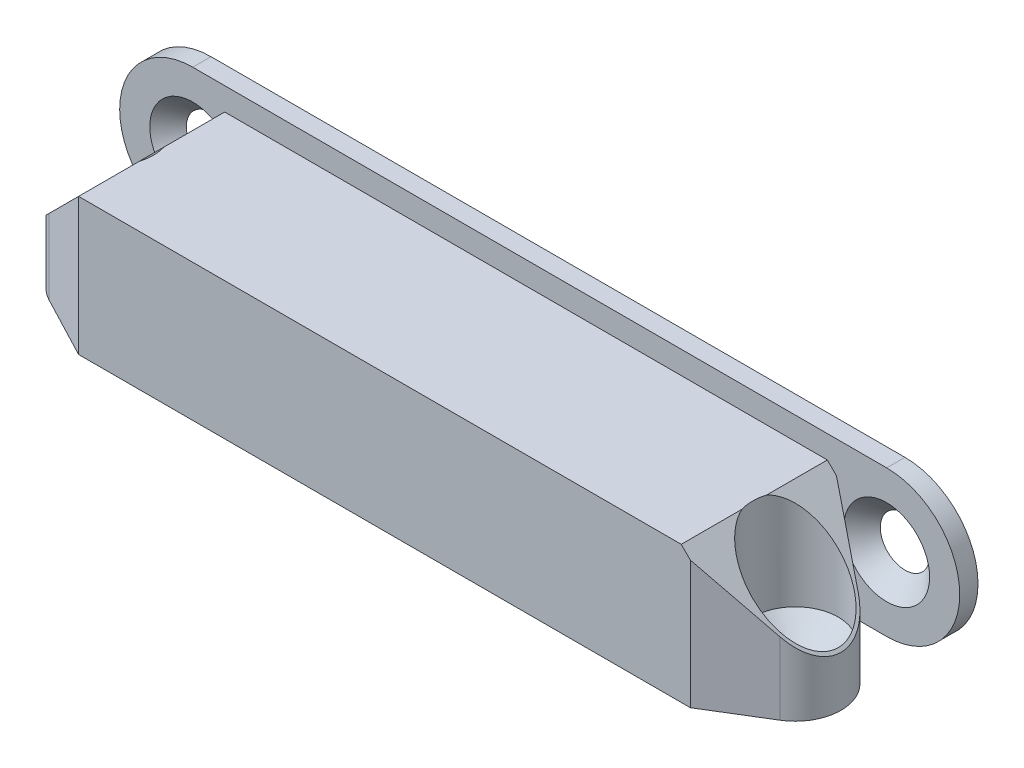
ISO-10303-21;
HEADER;
FILE_DESCRIPTION(('STEP AP214'),'2;1');
FILE_NAME('part.step','',(''),(''),'','','');
FILE_SCHEMA(('AUTOMOTIVE_DESIGN { 1 0 10303 214 1 1 1 1 }'));
ENDSEC;
DATA;
#1=APPLICATION_CONTEXT('core data for automotive mechanical design processes');
#2=APPLICATION_PROTOCOL_DEFINITION('international standard','automotive_design',2000,#1);
#3=PRODUCT_CONTEXT('',#1,'mechanical');
#4=PRODUCT('Part','Part','',(#3));
#5=PRODUCT_RELATED_PRODUCT_CATEGORY('part','',(#4));
#6=PRODUCT_DEFINITION_FORMATION('','',#4);
#7=PRODUCT_DEFINITION_CONTEXT('part definition',#1,'design');
#8=PRODUCT_DEFINITION('design','',#6,#7);
#9=PRODUCT_DEFINITION_SHAPE('','',#8);
#10=(LENGTH_UNIT() NAMED_UNIT(*) SI_UNIT(.MILLI.,.METRE.));
#11=(NAMED_UNIT(*) PLANE_ANGLE_UNIT() SI_UNIT($,.RADIAN.));
#12=(NAMED_UNIT(*) SI_UNIT($,.STERADIAN.) SOLID_ANGLE_UNIT());
#13=UNCERTAINTY_MEASURE_WITH_UNIT(LENGTH_MEASURE(1.E-05),#10,'distance_accuracy_value','');
#14=(GEOMETRIC_REPRESENTATION_CONTEXT(3) GLOBAL_UNCERTAINTY_ASSIGNED_CONTEXT((#13)) GLOBAL_UNIT_ASSIGNED_CONTEXT((#10,
#11,#12)) REPRESENTATION_CONTEXT('',''));
#15=CARTESIAN_POINT('',(0.,0.,0.));
#16=DIRECTION('',(0.,0.,1.));
#17=DIRECTION('',(1.,0.,0.));
#18=AXIS2_PLACEMENT_3D('',#15,#16,#17);
#19=CARTESIAN_POINT('',(34.,7.00000000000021,19.4999999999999));
#20=DIRECTION('',(0.,0.,1.));
#21=DIRECTION('',(1.,0.,0.));
#22=AXIS2_PLACEMENT_3D('',#19,#20,#21);
#23=PLANE('',#22);
#24=DIRECTION('',(0.,-1.,0.));
#25=VECTOR('',#24,1.);
#26=CARTESIAN_POINT('',(34.,7.00000000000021,19.4999999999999));
#27=LINE('',#26,#25);
#28=CARTESIAN_POINT('',(34.,6.00000000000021,19.4999999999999));
#29=VERTEX_POINT('',#28);
#30=CARTESIAN_POINT('',(34.,-7.99999999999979,19.4999999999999));
#31=VERTEX_POINT('',#30);
#32=EDGE_CURVE('E236',#29,#31,#27,.T.);
#33=ORIENTED_EDGE('',*,*,#32,.F.);
#34=DIRECTION('',(-0.707106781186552,0.707106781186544,0.));
#35=VECTOR('',#34,1.);
#36=CARTESIAN_POINT('',(33.,7.00000000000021,19.4999999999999));
#37=LINE('',#36,#35);
#38=CARTESIAN_POINT('',(33.,7.00000000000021,19.4999999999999));
#39=VERTEX_POINT('',#38);
#40=EDGE_CURVE('E150',#29,#39,#37,.T.);
#41=ORIENTED_EDGE('',*,*,#40,.T.);
#42=DIRECTION('',(-1.,0.,0.));
#43=VECTOR('',#42,1.);
#44=CARTESIAN_POINT('',(34.,7.00000000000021,19.4999999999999));
#45=LINE('',#44,#43);
#46=CARTESIAN_POINT('',(-33.0000000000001,7.0000000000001,19.5));
#47=VERTEX_POINT('',#46);
#48=EDGE_CURVE('E223',#39,#47,#45,.T.);
#49=ORIENTED_EDGE('',*,*,#48,.T.);
#50=DIRECTION('',(0.,-1.,0.));
#51=VECTOR('',#50,1.);
#52=CARTESIAN_POINT('',(-33.0000000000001,7.0000000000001,19.5));
#53=LINE('',#52,#51);
#54=CARTESIAN_POINT('',(-33.0000000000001,-7.99999999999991,19.5));
#55=VERTEX_POINT('',#54);
#56=EDGE_CURVE('E233',#47,#55,#53,.T.);
#57=ORIENTED_EDGE('',*,*,#56,.T.);
#58=DIRECTION('',(-1.,0.,0.));
#59=VECTOR('',#58,1.);
#60=CARTESIAN_POINT('',(34.,-7.99999999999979,19.4999999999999));
#61=LINE('',#60,#59);
#62=EDGE_CURVE('E208',#31,#55,#61,.T.);
#63=ORIENTED_EDGE('',*,*,#62,.F.);
#64=EDGE_LOOP('',(#33,#41,#49,#57,#63));
#65=FACE_BOUND('',#64,.T.);
#66=ADVANCED_FACE('F46',(#65),#23,.T.);
#67=CARTESIAN_POINT('',(40.1079530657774,7.00000000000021,15.7659794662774));
#68=DIRECTION('',(0.521590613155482,0.,0.853195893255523));
#69=DIRECTION('',(0.853195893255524,0.,-0.521590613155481));
#70=AXIS2_PLACEMENT_3D('',#67,#68,#69);
#71=PLANE('',#70);
#72=DIRECTION('',(0.,-1.,0.));
#73=VECTOR('',#72,1.);
#74=CARTESIAN_POINT('',(40.1079530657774,7.00000000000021,15.7659794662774));
#75=LINE('',#74,#73);
#76=CARTESIAN_POINT('',(40.1079530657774,-0.107953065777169,15.7659794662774));
#77=VERTEX_POINT('',#76);
#78=CARTESIAN_POINT('',(40.1079530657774,-7.99999999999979,15.7659794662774));
#79=VERTEX_POINT('',#78);
#80=EDGE_CURVE('E239',#77,#79,#75,.T.);
#81=ORIENTED_EDGE('',*,*,#80,.F.);
#82=DIRECTION('',(0.64905876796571,-0.649058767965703,-0.396793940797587));
#83=VECTOR('',#82,1.);
#84=CARTESIAN_POINT('',(37.2783843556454,2.72161564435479,17.4958008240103));
#85=LINE('',#84,#83);
#86=EDGE_CURVE('E292',#29,#77,#85,.T.);
#87=ORIENTED_EDGE('',*,*,#86,.F.);
#88=ORIENTED_EDGE('',*,*,#32,.T.);
#89=DIRECTION('',(-0.853195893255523,0.,0.521590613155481));
#90=VECTOR('',#89,1.);
#91=CARTESIAN_POINT('',(40.1079530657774,-7.99999999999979,15.7659794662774));
#92=LINE('',#91,#90);
#93=EDGE_CURVE('E204',#79,#31,#92,.T.);
#94=ORIENTED_EDGE('',*,*,#93,.F.);
#95=EDGE_LOOP('',(#81,#87,#88,#94));
#96=FACE_BOUND('',#95,.T.);
#97=ADVANCED_FACE('F289',(#96),#71,.T.);
#98=CARTESIAN_POINT('',(37.4999999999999,6.99999999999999,11.4999999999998));
#99=DIRECTION('',(0.,-1.,0.));
#100=DIRECTION('',(1.,0.,0.));
#101=AXIS2_PLACEMENT_3D('',#98,#99,#100);
#102=CYLINDRICAL_SURFACE('',#101,5.00000000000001);
#103=DIRECTION('',(0.,-1.,0.));
#104=VECTOR('',#103,1.);
#105=CARTESIAN_POINT('',(40.1079530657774,6.99999999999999,7.23402053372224));
#106=LINE('',#105,#104);
#107=CARTESIAN_POINT('',(40.1079530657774,-0.107953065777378,7.23402053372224));
#108=VERTEX_POINT('',#107);
#109=CARTESIAN_POINT('',(40.1079530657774,-8.00000000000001,7.23402053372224));
#110=VERTEX_POINT('',#109);
#111=EDGE_CURVE('E242',#108,#110,#106,.T.);
#112=ORIENTED_EDGE('',*,*,#111,.F.);
#113=CARTESIAN_POINT('',(37.4999999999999,2.50000000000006,11.4999999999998));
#114=DIRECTION('',(0.707106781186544,0.707106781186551,0.));
#115=DIRECTION('',(0.707106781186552,-0.707106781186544,0.));
#116=AXIS2_PLACEMENT_3D('',#113,#114,#115);
#117=ELLIPSE('',#116,7.07106781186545,5.00000000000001);
#118=EDGE_CURVE('E156',#77,#108,#117,.T.);
#119=ORIENTED_EDGE('',*,*,#118,.F.);
#120=ORIENTED_EDGE('',*,*,#80,.T.);
#121=CARTESIAN_POINT('',(37.4999999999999,-8.00000000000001,11.4999999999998));
#122=DIRECTION('',(0.,-1.,0.));
#123=DIRECTION('',(1.,0.,0.));
#124=AXIS2_PLACEMENT_3D('',#121,#122,#123);
#125=CIRCLE('',#124,5.00000000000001);
#126=EDGE_CURVE('E200',#110,#79,#125,.T.);
#127=ORIENTED_EDGE('',*,*,#126,.F.);
#128=EDGE_LOOP('',(#112,#119,#120,#127));
#129=FACE_BOUND('',#128,.T.);
#130=ADVANCED_FACE('F284',(#129),#102,.T.);
#131=CARTESIAN_POINT('',(34.,7.00000000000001,3.49999999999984));
#132=DIRECTION('',(0.52159061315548,0.,-0.853195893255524));
#133=DIRECTION('',(-0.853195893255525,0.,-0.521590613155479));
#134=AXIS2_PLACEMENT_3D('',#131,#132,#133);
#135=PLANE('',#134);
#136=DIRECTION('',(0.,-1.,0.));
#137=VECTOR('',#136,1.);
#138=CARTESIAN_POINT('',(34.,7.00000000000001,3.49999999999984));
#139=LINE('',#138,#137);
#140=CARTESIAN_POINT('',(34.,6.00000000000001,3.49999999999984));
#141=VERTEX_POINT('',#140);
#142=CARTESIAN_POINT('',(34.,-8.00000000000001,3.49999999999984));
#143=VERTEX_POINT('',#142);
#144=EDGE_CURVE('E245',#141,#143,#139,.T.);
#145=ORIENTED_EDGE('',*,*,#144,.F.);
#146=DIRECTION('',(-0.649058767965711,0.649058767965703,-0.396793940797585));
#147=VECTOR('',#146,1.);
#148=CARTESIAN_POINT('',(33.1571878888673,6.84281211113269,2.98475738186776));
#149=LINE('',#148,#147);
#150=EDGE_CURVE('E147',#108,#141,#149,.T.);
#151=ORIENTED_EDGE('',*,*,#150,.F.);
#152=ORIENTED_EDGE('',*,*,#111,.T.);
#153=DIRECTION('',(0.853195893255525,0.,0.521590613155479));
#154=VECTOR('',#153,1.);
#155=CARTESIAN_POINT('',(34.,-8.00000000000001,3.49999999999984));
#156=LINE('',#155,#154);
#157=EDGE_CURVE('E196',#143,#110,#156,.T.);
#158=ORIENTED_EDGE('',*,*,#157,.F.);
#159=EDGE_LOOP('',(#145,#151,#152,#158));
#160=FACE_BOUND('',#159,.T.);
#161=ADVANCED_FACE('F279',(#160),#135,.T.);
#162=CARTESIAN_POINT('',(-33.0000000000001,6.99999999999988,3.49999999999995));
#163=DIRECTION('',(0.,0.,-1.));
#164=DIRECTION('',(-1.,0.,0.));
#165=AXIS2_PLACEMENT_3D('',#162,#163,#164);
#166=PLANE('',#165);
#167=DIRECTION('',(1.,0.,0.));
#168=VECTOR('',#167,1.);
#169=CARTESIAN_POINT('',(-33.0000000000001,6.99999999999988,3.49999999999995));
#170=LINE('',#169,#168);
#171=CARTESIAN_POINT('',(-33.0000000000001,6.99999999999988,3.49999999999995));
#172=VERTEX_POINT('',#171);
#173=CARTESIAN_POINT('',(33.,7.00000000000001,3.49999999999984));
#174=VERTEX_POINT('',#173);
#175=EDGE_CURVE('E220',#172,#174,#170,.T.);
#176=ORIENTED_EDGE('',*,*,#175,.T.);
#177=DIRECTION('',(-0.707106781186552,0.707106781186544,0.));
#178=VECTOR('',#177,1.);
#179=CARTESIAN_POINT('',(33.,7.00000000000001,3.49999999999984));
#180=LINE('',#179,#178);
#181=EDGE_CURVE('E69',#141,#174,#180,.T.);
#182=ORIENTED_EDGE('',*,*,#181,.F.);
#183=ORIENTED_EDGE('',*,*,#144,.T.);
#184=DIRECTION('',(1.,0.,0.));
#185=VECTOR('',#184,1.);
#186=CARTESIAN_POINT('',(-33.0000000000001,-8.00000000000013,3.49999999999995));
#187=LINE('',#186,#185);
#188=CARTESIAN_POINT('',(-33.0000000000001,-8.00000000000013,3.49999999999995));
#189=VERTEX_POINT('',#188);
#190=EDGE_CURVE('E192',#189,#143,#187,.T.);
#191=ORIENTED_EDGE('',*,*,#190,.F.);
#192=DIRECTION('',(0.,-1.,0.));
#193=VECTOR('',#192,1.);
#194=CARTESIAN_POINT('',(-33.0000000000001,6.99999999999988,3.49999999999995));
#195=LINE('',#194,#193);
#196=EDGE_CURVE('E226',#172,#189,#195,.T.);
#197=ORIENTED_EDGE('',*,*,#196,.F.);
#198=EDGE_LOOP('',(#176,#182,#183,#191,#197));
#199=FACE_BOUND('',#198,.T.);
#200=ADVANCED_FACE('F274',(#199),#166,.T.);
#201=CARTESIAN_POINT('',(37.4999999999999,6.99999999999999,11.4999999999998));
#202=DIRECTION('',(0.,-1.,0.));
#203=DIRECTION('',(1.,0.,0.));
#204=AXIS2_PLACEMENT_3D('',#201,#202,#203);
#205=PLANE('',#204);
#206=DIRECTION('',(0.,0.,1.));
#207=VECTOR('',#206,1.);
#208=CARTESIAN_POINT('',(33.,7.00000000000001,3.49899999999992));
#209=LINE('',#208,#207);
#210=CARTESIAN_POINT('',(33.,7.00000000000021,12.8564659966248));
#211=VERTEX_POINT('',#210);
#212=EDGE_CURVE('E137',#211,#39,#209,.T.);
#213=ORIENTED_EDGE('',*,*,#212,.F.);
#214=CARTESIAN_POINT('',(37.4999999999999,6.99999999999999,11.4999999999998));
#215=DIRECTION('',(0.,1.,0.));
#216=DIRECTION('',(0.,0.,1.));
#217=AXIS2_PLACEMENT_3D('',#214,#215,#216);
#218=CIRCLE('',#217,4.7);
#219=CARTESIAN_POINT('',(33.,6.99999999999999,10.1435340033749));
#220=VERTEX_POINT('',#219);
#221=EDGE_CURVE('E61',#220,#211,#218,.T.);
#222=ORIENTED_EDGE('',*,*,#221,.F.);
#223=EDGE_CURVE('E134',#174,#220,#209,.T.);
#224=ORIENTED_EDGE('',*,*,#223,.F.);
#225=ORIENTED_EDGE('',*,*,#175,.F.);
#226=DIRECTION('',(0.,0.,1.));
#227=VECTOR('',#226,1.);
#228=CARTESIAN_POINT('',(-33.0000000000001,6.99999999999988,-0.00100000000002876));
#229=LINE('',#228,#227);
#230=CARTESIAN_POINT('',(-33.0000000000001,6.99999999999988,10.143534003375));
#231=VERTEX_POINT('',#230);
#232=EDGE_CURVE('E176',#172,#231,#229,.T.);
#233=ORIENTED_EDGE('',*,*,#232,.T.);
#234=CARTESIAN_POINT('',(-37.5000000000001,6.99999999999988,11.5));
#235=DIRECTION('',(0.,1.,0.));
#236=DIRECTION('',(0.,0.,1.));
#237=AXIS2_PLACEMENT_3D('',#234,#235,#236);
#238=CIRCLE('',#237,4.7);
#239=CARTESIAN_POINT('',(-33.0000000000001,7.0000000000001,12.8564659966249));
#240=VERTEX_POINT('',#239);
#241=EDGE_CURVE('E159',#240,#231,#238,.T.);
#242=ORIENTED_EDGE('',*,*,#241,.F.);
#243=EDGE_CURVE('E175',#240,#47,#229,.T.);
#244=ORIENTED_EDGE('',*,*,#243,.T.);
#245=ORIENTED_EDGE('',*,*,#48,.F.);
#246=EDGE_LOOP('',(#213,#222,#224,#225,#233,#242,#244,#245));
#247=FACE_BOUND('',#246,.T.);
#248=ADVANCED_FACE('F132',(#247),#205,.F.);
#249=CARTESIAN_POINT('',(-39.8192413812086,6.99999999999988,7.07042672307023));
#250=DIRECTION('',(-0.463848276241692,0.,-0.885914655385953));
#251=DIRECTION('',(-0.885914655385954,0.,0.463848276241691));
#252=AXIS2_PLACEMENT_3D('',#249,#250,#251);
#253=PLANE('',#252);
#254=DIRECTION('',(0.663119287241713,0.663119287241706,-0.347196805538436));
#255=VECTOR('',#254,1.);
#256=CARTESIAN_POINT('',(-32.1939546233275,7.8060453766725,3.07796977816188));
#257=LINE('',#256,#255);
#258=CARTESIAN_POINT('',(-39.8192413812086,0.180758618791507,7.07042672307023));
#259=VERTEX_POINT('',#258);
#260=EDGE_CURVE('E184',#259,#172,#257,.T.);
#261=ORIENTED_EDGE('',*,*,#260,.T.);
#262=ORIENTED_EDGE('',*,*,#196,.T.);
#263=DIRECTION('',(0.885914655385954,0.,-0.463848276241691));
#264=VECTOR('',#263,1.);
#265=CARTESIAN_POINT('',(-39.8192413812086,-8.00000000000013,7.07042672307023));
#266=LINE('',#265,#264);
#267=CARTESIAN_POINT('',(-39.8192413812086,-8.00000000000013,7.07042672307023));
#268=VERTEX_POINT('',#267);
#269=EDGE_CURVE('E188',#268,#189,#266,.T.);
#270=ORIENTED_EDGE('',*,*,#269,.F.);
#271=DIRECTION('',(0.,-1.,0.));
#272=VECTOR('',#271,1.);
#273=CARTESIAN_POINT('',(-39.8192413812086,6.99999999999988,7.07042672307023));
#274=LINE('',#273,#272);
#275=EDGE_CURVE('E227',#259,#268,#274,.T.);
#276=ORIENTED_EDGE('',*,*,#275,.F.);
#277=EDGE_LOOP('',(#261,#262,#270,#276));
#278=FACE_BOUND('',#277,.T.);
#279=ADVANCED_FACE('F48',(#278),#253,.T.);
#280=CARTESIAN_POINT('',(-37.5000000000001,6.99999999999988,11.5));
#281=DIRECTION('',(0.,-1.,0.));
#282=DIRECTION('',(1.,0.,0.));
#283=AXIS2_PLACEMENT_3D('',#280,#281,#282);
#284=CYLINDRICAL_SURFACE('',#283,5.);
#285=CARTESIAN_POINT('',(-37.5000000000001,2.49999999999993,11.5));
#286=DIRECTION('',(0.707106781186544,-0.707106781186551,0.));
#287=DIRECTION('',(-0.707106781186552,-0.707106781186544,0.));
#288=AXIS2_PLACEMENT_3D('',#285,#286,#287);
#289=ELLIPSE('',#288,7.07106781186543,5.);
#290=CARTESIAN_POINT('',(-39.8192413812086,0.180758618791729,15.9295732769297));
#291=VERTEX_POINT('',#290);
#292=EDGE_CURVE('E180',#291,#259,#289,.T.);
#293=ORIENTED_EDGE('',*,*,#292,.T.);
#294=ORIENTED_EDGE('',*,*,#275,.T.);
#295=CARTESIAN_POINT('',(-37.5000000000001,-8.00000000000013,11.5));
#296=DIRECTION('',(0.,-1.,0.));
#297=DIRECTION('',(1.,0.,0.));
#298=AXIS2_PLACEMENT_3D('',#295,#296,#297);
#299=CIRCLE('',#298,5.);
#300=CARTESIAN_POINT('',(-39.8192413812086,-7.99999999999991,15.9295732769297));
#301=VERTEX_POINT('',#300);
#302=EDGE_CURVE('E216',#301,#268,#299,.T.);
#303=ORIENTED_EDGE('',*,*,#302,.F.);
#304=DIRECTION('',(0.,-1.,0.));
#305=VECTOR('',#304,1.);
#306=CARTESIAN_POINT('',(-39.8192413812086,7.0000000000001,15.9295732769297));
#307=LINE('',#306,#305);
#308=EDGE_CURVE('E230',#291,#301,#307,.T.);
#309=ORIENTED_EDGE('',*,*,#308,.F.);
#310=EDGE_LOOP('',(#293,#294,#303,#309));
#311=FACE_BOUND('',#310,.T.);
#312=ADVANCED_FACE('F300',(#311),#284,.T.);
#313=CARTESIAN_POINT('',(-33.0000000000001,7.0000000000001,19.5));
#314=DIRECTION('',(-0.463848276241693,0.,0.885914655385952));
#315=DIRECTION('',(0.885914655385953,0.,0.463848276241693));
#316=AXIS2_PLACEMENT_3D('',#313,#314,#315);
#317=PLANE('',#316);
#318=DIRECTION('',(-0.663119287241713,-0.663119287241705,-0.347196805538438));
#319=VECTOR('',#318,1.);
#320=CARTESIAN_POINT('',(-37.4897717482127,2.51022825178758,17.1492398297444));
#321=LINE('',#320,#319);
#322=EDGE_CURVE('E171',#47,#291,#321,.T.);
#323=ORIENTED_EDGE('',*,*,#322,.T.);
#324=ORIENTED_EDGE('',*,*,#308,.T.);
#325=DIRECTION('',(-0.885914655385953,0.,-0.463848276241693));
#326=VECTOR('',#325,1.);
#327=CARTESIAN_POINT('',(-33.0000000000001,-7.99999999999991,19.5));
#328=LINE('',#327,#326);
#329=EDGE_CURVE('E212',#55,#301,#328,.T.);
#330=ORIENTED_EDGE('',*,*,#329,.F.);
#331=ORIENTED_EDGE('',*,*,#56,.F.);
#332=EDGE_LOOP('',(#323,#324,#330,#331));
#333=FACE_BOUND('',#332,.T.);
#334=ADVANCED_FACE('F264',(#333),#317,.T.);
#335=CARTESIAN_POINT('',(37.4999999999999,-8.00000000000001,11.4999999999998));
#336=DIRECTION('',(0.,-1.,0.));
#337=DIRECTION('',(1.,0.,0.));
#338=AXIS2_PLACEMENT_3D('',#335,#336,#337);
#339=PLANE('',#338);
#340=CARTESIAN_POINT('',(37.4999999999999,-8.00000000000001,11.4999999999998));
#341=DIRECTION('',(0.,-1.,0.));
#342=DIRECTION('',(1.,0.,0.));
#343=AXIS2_PLACEMENT_3D('',#340,#341,#342);
#344=CIRCLE('',#343,2.15);
#345=CARTESIAN_POINT('',(37.4999999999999,-8.00000000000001,13.6499999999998));
#346=VERTEX_POINT('',#345);
#347=EDGE_CURVE('E50',#346,#346,#344,.T.);
#348=ORIENTED_EDGE('',*,*,#347,.F.);
#349=EDGE_LOOP('',(#348));
#350=FACE_BOUND('',#349,.T.);
#351=CARTESIAN_POINT('',(-37.5000000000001,-8.00000000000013,11.5));
#352=DIRECTION('',(0.,-1.,0.));
#353=DIRECTION('',(1.,0.,0.));
#354=AXIS2_PLACEMENT_3D('',#351,#352,#353);
#355=CIRCLE('',#354,2.15);
#356=CARTESIAN_POINT('',(-37.5000000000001,-8.00000000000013,13.65));
#357=VERTEX_POINT('',#356);
#358=EDGE_CURVE('E170',#357,#357,#355,.T.);
#359=ORIENTED_EDGE('',*,*,#358,.F.);
#360=EDGE_LOOP('',(#359));
#361=FACE_BOUND('',#360,.T.);
#362=ORIENTED_EDGE('',*,*,#269,.T.);
#363=ORIENTED_EDGE('',*,*,#190,.T.);
#364=ORIENTED_EDGE('',*,*,#157,.T.);
#365=ORIENTED_EDGE('',*,*,#126,.T.);
#366=ORIENTED_EDGE('',*,*,#93,.T.);
#367=ORIENTED_EDGE('',*,*,#62,.T.);
#368=ORIENTED_EDGE('',*,*,#329,.T.);
#369=ORIENTED_EDGE('',*,*,#302,.T.);
#370=EDGE_LOOP('',(#362,#363,#364,#365,#366,#367,#368,#369));
#371=FACE_BOUND('',#370,.T.);
#372=ADVANCED_FACE('F260',(#350,#361,#371),#339,.T.);
#373=CARTESIAN_POINT('',(-33.0000000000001,6.99999999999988,-0.00100000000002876));
#374=DIRECTION('',(0.707106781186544,-0.707106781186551,0.));
#375=DIRECTION('',(0.707106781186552,0.707106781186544,0.));
#376=AXIS2_PLACEMENT_3D('',#373,#374,#375);
#377=PLANE('',#376);
#378=ORIENTED_EDGE('',*,*,#243,.F.);
#379=CARTESIAN_POINT('',(-37.5000000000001,2.49999999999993,11.5));
#380=DIRECTION('',(0.707106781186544,-0.707106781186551,0.));
#381=DIRECTION('',(0.707106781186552,0.707106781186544,0.));
#382=AXIS2_PLACEMENT_3D('',#379,#380,#381);
#383=ELLIPSE('',#382,6.64680374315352,4.7);
#384=EDGE_CURVE('E56',#240,#231,#383,.T.);
#385=ORIENTED_EDGE('',*,*,#384,.T.);
#386=ORIENTED_EDGE('',*,*,#232,.F.);
#387=ORIENTED_EDGE('',*,*,#260,.F.);
#388=ORIENTED_EDGE('',*,*,#292,.F.);
#389=ORIENTED_EDGE('',*,*,#322,.F.);
#390=EDGE_LOOP('',(#378,#385,#386,#387,#388,#389));
#391=FACE_BOUND('',#390,.T.);
#392=ADVANCED_FACE('F263',(#391),#377,.F.);
#393=CARTESIAN_POINT('',(-37.5000000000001,6.99999999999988,11.5));
#394=DIRECTION('',(0.,1.,0.));
#395=DIRECTION('',(0.,0.,1.));
#396=AXIS2_PLACEMENT_3D('',#393,#394,#395);
#397=CYLINDRICAL_SURFACE('',#396,4.7);
#398=CARTESIAN_POINT('',(-37.5000000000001,-4.00000000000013,11.5));
#399=DIRECTION('',(0.,1.,0.));
#400=DIRECTION('',(0.,0.,1.));
#401=AXIS2_PLACEMENT_3D('',#398,#399,#400);
#402=CIRCLE('',#401,4.7);
#403=CARTESIAN_POINT('',(-37.5000000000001,-4.00000000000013,16.2));
#404=VERTEX_POINT('',#403);
#405=EDGE_CURVE('E162',#404,#404,#402,.T.);
#406=ORIENTED_EDGE('',*,*,#405,.F.);
#407=EDGE_LOOP('',(#406));
#408=FACE_BOUND('',#407,.T.);
#409=ORIENTED_EDGE('',*,*,#241,.T.);
#410=ORIENTED_EDGE('',*,*,#384,.F.);
#411=EDGE_LOOP('',(#409,#410));
#412=FACE_BOUND('',#411,.T.);
#413=ADVANCED_FACE('F331',(#408,#412),#397,.F.);
#414=CARTESIAN_POINT('',(-37.5000000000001,6.99999999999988,11.5));
#415=DIRECTION('',(0.,1.,0.));
#416=DIRECTION('',(0.,0.,1.));
#417=AXIS2_PLACEMENT_3D('',#414,#415,#416);
#418=CYLINDRICAL_SURFACE('',#417,2.15);
#419=CARTESIAN_POINT('',(-37.5000000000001,-6.55000000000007,11.5));
#420=DIRECTION('',(0.,1.,0.));
#421=DIRECTION('',(0.,0.,1.));
#422=AXIS2_PLACEMENT_3D('',#419,#420,#421);
#423=CIRCLE('',#422,2.15000000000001);
#424=CARTESIAN_POINT('',(-37.5000000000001,-6.55000000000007,13.65));
#425=VERTEX_POINT('',#424);
#426=EDGE_CURVE('E166',#425,#425,#423,.T.);
#427=CARTESIAN_POINT('',(-37.5000000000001,-8.00000000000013,13.65));
#428=CARTESIAN_POINT('',(-37.5000000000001,-7.98489583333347,13.65));
#429=CARTESIAN_POINT('',(-37.5000000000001,-7.9697916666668,13.65));
#430=CARTESIAN_POINT('',(-37.5000000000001,-7.93958333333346,13.65));
#431=CARTESIAN_POINT('',(-37.5000000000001,-7.92447916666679,13.65));
#432=CARTESIAN_POINT('',(-37.5000000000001,-7.89427083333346,13.65));
#433=CARTESIAN_POINT('',(-37.5000000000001,-7.87916666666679,13.65));
#434=CARTESIAN_POINT('',(-37.5000000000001,-7.84895833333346,13.65));
#435=CARTESIAN_POINT('',(-37.5000000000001,-7.83385416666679,13.65));
#436=CARTESIAN_POINT('',(-37.5000000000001,-7.80364583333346,13.65));
#437=CARTESIAN_POINT('',(-37.5000000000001,-7.78854166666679,13.65));
#438=CARTESIAN_POINT('',(-37.5000000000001,-7.75833333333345,13.65));
#439=CARTESIAN_POINT('',(-37.5000000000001,-7.74322916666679,13.65));
#440=CARTESIAN_POINT('',(-37.5000000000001,-7.71302083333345,13.65));
#441=CARTESIAN_POINT('',(-37.5000000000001,-7.69791666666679,13.65));
#442=CARTESIAN_POINT('',(-37.5000000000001,-7.66770833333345,13.65));
#443=CARTESIAN_POINT('',(-37.5000000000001,-7.65260416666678,13.65));
#444=CARTESIAN_POINT('',(-37.5000000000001,-7.62239583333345,13.65));
#445=CARTESIAN_POINT('',(-37.5000000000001,-7.60729166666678,13.65));
#446=CARTESIAN_POINT('',(-37.5000000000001,-7.57708333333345,13.65));
#447=CARTESIAN_POINT('',(-37.5000000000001,-7.56197916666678,13.65));
#448=CARTESIAN_POINT('',(-37.5000000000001,-7.53177083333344,13.65));
#449=CARTESIAN_POINT('',(-37.5000000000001,-7.51666666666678,13.65));
#450=CARTESIAN_POINT('',(-37.5000000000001,-7.48645833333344,13.65));
#451=CARTESIAN_POINT('',(-37.5000000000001,-7.47135416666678,13.65));
#452=CARTESIAN_POINT('',(-37.5000000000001,-7.44114583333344,13.65));
#453=CARTESIAN_POINT('',(-37.5000000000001,-7.42604166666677,13.65));
#454=CARTESIAN_POINT('',(-37.5000000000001,-7.39583333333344,13.65));
#455=CARTESIAN_POINT('',(-37.5000000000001,-7.38072916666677,13.65));
#456=CARTESIAN_POINT('',(-37.5000000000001,-7.35052083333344,13.65));
#457=CARTESIAN_POINT('',(-37.5000000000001,-7.33541666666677,13.65));
#458=CARTESIAN_POINT('',(-37.5000000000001,-7.30520833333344,13.65));
#459=CARTESIAN_POINT('',(-37.5000000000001,-7.29010416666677,13.65));
#460=CARTESIAN_POINT('',(-37.5000000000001,-7.25989583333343,13.65));
#461=CARTESIAN_POINT('',(-37.5000000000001,-7.24479166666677,13.65));
#462=CARTESIAN_POINT('',(-37.5000000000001,-7.21458333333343,13.65));
#463=CARTESIAN_POINT('',(-37.5000000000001,-7.19947916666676,13.65));
#464=CARTESIAN_POINT('',(-37.5000000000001,-7.16927083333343,13.65));
#465=CARTESIAN_POINT('',(-37.5000000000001,-7.15416666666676,13.65));
#466=CARTESIAN_POINT('',(-37.5000000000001,-7.12395833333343,13.65));
#467=CARTESIAN_POINT('',(-37.5000000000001,-7.10885416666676,13.65));
#468=CARTESIAN_POINT('',(-37.5000000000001,-7.07864583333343,13.65));
#469=CARTESIAN_POINT('',(-37.5000000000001,-7.06354166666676,13.65));
#470=CARTESIAN_POINT('',(-37.5000000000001,-7.03333333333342,13.65));
#471=CARTESIAN_POINT('',(-37.5000000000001,-7.01822916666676,13.65));
#472=CARTESIAN_POINT('',(-37.5000000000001,-6.98802083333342,13.65));
#473=CARTESIAN_POINT('',(-37.5000000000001,-6.97291666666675,13.65));
#474=CARTESIAN_POINT('',(-37.5000000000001,-6.94270833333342,13.65));
#475=CARTESIAN_POINT('',(-37.5000000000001,-6.92760416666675,13.65));
#476=CARTESIAN_POINT('',(-37.5000000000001,-6.89739583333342,13.65));
#477=CARTESIAN_POINT('',(-37.5000000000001,-6.88229166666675,13.65));
#478=CARTESIAN_POINT('',(-37.5000000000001,-6.85208333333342,13.65));
#479=CARTESIAN_POINT('',(-37.5000000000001,-6.83697916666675,13.65));
#480=CARTESIAN_POINT('',(-37.5000000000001,-6.80677083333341,13.65));
#481=CARTESIAN_POINT('',(-37.5000000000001,-6.79166666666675,13.65));
#482=CARTESIAN_POINT('',(-37.5000000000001,-6.76145833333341,13.65));
#483=CARTESIAN_POINT('',(-37.5000000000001,-6.74635416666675,13.65));
#484=CARTESIAN_POINT('',(-37.5000000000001,-6.71614583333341,13.65));
#485=CARTESIAN_POINT('',(-37.5000000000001,-6.70104166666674,13.65));
#486=CARTESIAN_POINT('',(-37.5000000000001,-6.67083333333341,13.65));
#487=CARTESIAN_POINT('',(-37.5000000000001,-6.65572916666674,13.65));
#488=CARTESIAN_POINT('',(-37.5000000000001,-6.62552083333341,13.65));
#489=CARTESIAN_POINT('',(-37.5000000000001,-6.61041666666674,13.65));
#490=CARTESIAN_POINT('',(-37.5000000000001,-6.5802083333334,13.65));
#491=CARTESIAN_POINT('',(-37.5000000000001,-6.56510416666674,13.65));
#492=CARTESIAN_POINT('',(-37.5000000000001,-6.55000000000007,13.65));
#493=B_SPLINE_CURVE_WITH_KNOTS('',3,(#427,#428,#429,#430,#431,#432,#433,#434,#435,#436,#437,
#438,#439,#440,#441,#442,#443,#444,#445,#446,#447,#448,#449,#450,#451,#452,#453,#454,#455,#456,
#457,#458,#459,#460,#461,#462,#463,#464,#465,#466,#467,#468,#469,#470,#471,#472,#473,#474,#475,
#476,#477,#478,#479,#480,#481,#482,#483,#484,#485,#486,#487,#488,#489,#490,#491,#492),
.UNSPECIFIED.,.F.,.F.,(4,2,2,2,2,2,2,2,2,2,2,2,2,2,2,2,2,2,2,2,2,2,2,2,2,2,2,2,2,2,2,2,4),(0.,
0.0453125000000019,0.0906250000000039,0.135937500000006,0.181250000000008,0.22656250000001,
0.271875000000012,0.317187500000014,0.362500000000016,0.407812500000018,0.453125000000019,
0.498437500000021,0.543750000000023,0.589062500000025,0.634375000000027,0.679687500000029,
0.725000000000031,0.770312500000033,0.815625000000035,0.860937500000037,0.906250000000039,
0.951562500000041,0.996875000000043,1.04218750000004,1.08750000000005,1.13281250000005,
1.17812500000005,1.22343750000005,1.26875000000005,1.31406250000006,1.35937500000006,
1.40468750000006,1.45000000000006),.UNSPECIFIED.);
#494=EDGE_CURVE('BSEAM257',#357,#425,#493,.T.);
#495=ORIENTED_EDGE('',*,*,#358,.T.);
#496=ORIENTED_EDGE('',*,*,#426,.T.);
#497=ORIENTED_EDGE('',*,*,#494,.T.);
#498=ORIENTED_EDGE('',*,*,#494,.F.);
#499=EDGE_LOOP('',(#495,#497,#496,#498));
#500=FACE_BOUND('',#499,.T.);
#501=ADVANCED_FACE('F257',(#500),#418,.F.);
#502=CARTESIAN_POINT('',(-37.5000000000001,-4.00000000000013,11.5));
#503=DIRECTION('',(0.,1.,0.));
#504=DIRECTION('',(0.,0.,1.));
#505=AXIS2_PLACEMENT_3D('',#502,#503,#504);
#506=CONICAL_SURFACE('',#505,4.7,0.785398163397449);
#507=CARTESIAN_POINT('',(-37.5000000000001,-6.55000000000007,13.65));
#508=CARTESIAN_POINT('',(-37.5000000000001,-6.52343750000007,13.6765625));
#509=CARTESIAN_POINT('',(-37.5000000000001,-6.49687500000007,13.703125));
#510=CARTESIAN_POINT('',(-37.5000000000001,-6.44375000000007,13.75625));
#511=CARTESIAN_POINT('',(-37.5000000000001,-6.41718750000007,13.7828125));
#512=CARTESIAN_POINT('',(-37.5000000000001,-6.36406250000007,13.8359375));
#513=CARTESIAN_POINT('',(-37.5000000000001,-6.33750000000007,13.8625));
#514=CARTESIAN_POINT('',(-37.5000000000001,-6.28437500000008,13.915625));
#515=CARTESIAN_POINT('',(-37.5000000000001,-6.25781250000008,13.9421875));
#516=CARTESIAN_POINT('',(-37.5000000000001,-6.20468750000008,13.9953125));
#517=CARTESIAN_POINT('',(-37.5000000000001,-6.17812500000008,14.021875));
#518=CARTESIAN_POINT('',(-37.5000000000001,-6.12500000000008,14.075));
#519=CARTESIAN_POINT('',(-37.5000000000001,-6.09843750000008,14.1015625));
#520=CARTESIAN_POINT('',(-37.5000000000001,-6.04531250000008,14.1546875));
#521=CARTESIAN_POINT('',(-37.5000000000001,-6.01875000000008,14.18125));
#522=CARTESIAN_POINT('',(-37.5000000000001,-5.96562500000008,14.234375));
#523=CARTESIAN_POINT('',(-37.5000000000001,-5.93906250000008,14.2609375));
#524=CARTESIAN_POINT('',(-37.5000000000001,-5.88593750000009,14.3140625));
#525=CARTESIAN_POINT('',(-37.5000000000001,-5.85937500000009,14.340625));
#526=CARTESIAN_POINT('',(-37.5000000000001,-5.80625000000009,14.39375));
#527=CARTESIAN_POINT('',(-37.5000000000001,-5.77968750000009,14.4203125));
#528=CARTESIAN_POINT('',(-37.5000000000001,-5.72656250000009,14.4734375));
#529=CARTESIAN_POINT('',(-37.5000000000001,-5.70000000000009,14.5));
#530=CARTESIAN_POINT('',(-37.5000000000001,-5.64687500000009,14.553125));
#531=CARTESIAN_POINT('',(-37.5000000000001,-5.62031250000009,14.5796875));
#532=CARTESIAN_POINT('',(-37.5000000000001,-5.56718750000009,14.6328125));
#533=CARTESIAN_POINT('',(-37.5000000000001,-5.54062500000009,14.659375));
#534=CARTESIAN_POINT('',(-37.5000000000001,-5.48750000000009,14.7125));
#535=CARTESIAN_POINT('',(-37.5000000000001,-5.46093750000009,14.7390625));
#536=CARTESIAN_POINT('',(-37.5000000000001,-5.4078125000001,14.7921875));
#537=CARTESIAN_POINT('',(-37.5000000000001,-5.3812500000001,14.81875));
#538=CARTESIAN_POINT('',(-37.5000000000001,-5.3281250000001,14.871875));
#539=CARTESIAN_POINT('',(-37.5000000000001,-5.3015625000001,14.8984375));
#540=CARTESIAN_POINT('',(-37.5000000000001,-5.2484375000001,14.9515625));
#541=CARTESIAN_POINT('',(-37.5000000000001,-5.2218750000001,14.978125));
#542=CARTESIAN_POINT('',(-37.5000000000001,-5.1687500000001,15.03125));
#543=CARTESIAN_POINT('',(-37.5000000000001,-5.1421875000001,15.0578125));
#544=CARTESIAN_POINT('',(-37.5000000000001,-5.0890625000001,15.1109375));
#545=CARTESIAN_POINT('',(-37.5000000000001,-5.0625000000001,15.1375));
#546=CARTESIAN_POINT('',(-37.5000000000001,-5.00937500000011,15.190625));
#547=CARTESIAN_POINT('',(-37.5000000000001,-4.98281250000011,15.2171875));
#548=CARTESIAN_POINT('',(-37.5000000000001,-4.92968750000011,15.2703125));
#549=CARTESIAN_POINT('',(-37.5000000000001,-4.90312500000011,15.296875));
#550=CARTESIAN_POINT('',(-37.5000000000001,-4.85000000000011,15.35));
#551=CARTESIAN_POINT('',(-37.5000000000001,-4.82343750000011,15.3765625));
#552=CARTESIAN_POINT('',(-37.5000000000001,-4.77031250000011,15.4296875));
#553=CARTESIAN_POINT('',(-37.5000000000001,-4.74375000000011,15.45625));
#554=CARTESIAN_POINT('',(-37.5000000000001,-4.69062500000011,15.509375));
#555=CARTESIAN_POINT('',(-37.5000000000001,-4.66406250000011,15.5359375));
#556=CARTESIAN_POINT('',(-37.5000000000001,-4.61093750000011,15.5890625));
#557=CARTESIAN_POINT('',(-37.5000000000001,-4.58437500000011,15.615625));
#558=CARTESIAN_POINT('',(-37.5000000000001,-4.53125000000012,15.66875));
#559=CARTESIAN_POINT('',(-37.5000000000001,-4.50468750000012,15.6953125));
#560=CARTESIAN_POINT('',(-37.5000000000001,-4.45156250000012,15.7484375));
#561=CARTESIAN_POINT('',(-37.5000000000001,-4.42500000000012,15.775));
#562=CARTESIAN_POINT('',(-37.5000000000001,-4.37187500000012,15.828125));
#563=CARTESIAN_POINT('',(-37.5000000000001,-4.34531250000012,15.8546875));
#564=CARTESIAN_POINT('',(-37.5000000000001,-4.29218750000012,15.9078125));
#565=CARTESIAN_POINT('',(-37.5000000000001,-4.26562500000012,15.934375));
#566=CARTESIAN_POINT('',(-37.5000000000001,-4.21250000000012,15.9875));
#567=CARTESIAN_POINT('',(-37.5000000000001,-4.18593750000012,16.0140625));
#568=CARTESIAN_POINT('',(-37.5000000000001,-4.13281250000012,16.0671875));
#569=CARTESIAN_POINT('',(-37.5000000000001,-4.10625000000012,16.09375));
#570=CARTESIAN_POINT('',(-37.5000000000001,-4.05312500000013,16.146875));
#571=CARTESIAN_POINT('',(-37.5000000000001,-4.02656250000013,16.1734375));
#572=CARTESIAN_POINT('',(-37.5000000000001,-4.00000000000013,16.2));
#573=B_SPLINE_CURVE_WITH_KNOTS('',3,(#507,#508,#509,#510,#511,#512,#513,#514,#515,#516,#517,
#518,#519,#520,#521,#522,#523,#524,#525,#526,#527,#528,#529,#530,#531,#532,#533,#534,#535,#536,
#537,#538,#539,#540,#541,#542,#543,#544,#545,#546,#547,#548,#549,#550,#551,#552,#553,#554,#555,
#556,#557,#558,#559,#560,#561,#562,#563,#564,#565,#566,#567,#568,#569,#570,#571,#572),
.UNSPECIFIED.,.F.,.F.,(4,2,2,2,2,2,2,2,2,2,2,2,2,2,2,2,2,2,2,2,2,2,2,2,2,2,2,2,2,2,2,2,4),(0.,
0.112695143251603,0.225390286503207,0.33808542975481,0.450780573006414,0.563475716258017,
0.676170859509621,0.788866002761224,0.901561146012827,1.01425628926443,1.12695143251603,
1.23964657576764,1.35234171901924,1.46503686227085,1.57773200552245,1.69042714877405,
1.80312229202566,1.91581743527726,2.02851257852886,2.14120772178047,2.25390286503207,
2.36659800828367,2.47929315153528,2.59198829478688,2.70468343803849,2.81737858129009,
2.93007372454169,3.0427688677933,3.1554640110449,3.2681591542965,3.3808542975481,
3.49354944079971,3.60624458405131),.UNSPECIFIED.);
#574=EDGE_CURVE('BSEAM334',#425,#404,#573,.T.);
#575=ORIENTED_EDGE('',*,*,#426,.F.);
#576=ORIENTED_EDGE('',*,*,#405,.T.);
#577=ORIENTED_EDGE('',*,*,#574,.T.);
#578=ORIENTED_EDGE('',*,*,#574,.F.);
#579=EDGE_LOOP('',(#575,#577,#576,#578));
#580=FACE_BOUND('',#579,.T.);
#581=ADVANCED_FACE('F334',(#580),#506,.F.);
#582=CARTESIAN_POINT('',(33.,7.00000000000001,3.49899999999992));
#583=DIRECTION('',(0.707106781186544,0.707106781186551,0.));
#584=DIRECTION('',(-0.707106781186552,0.707106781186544,0.));
#585=AXIS2_PLACEMENT_3D('',#582,#583,#584);
#586=PLANE('',#585);
#587=CARTESIAN_POINT('',(37.4999999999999,2.50000000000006,11.4999999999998));
#588=DIRECTION('',(0.707106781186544,0.707106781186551,0.));
#589=DIRECTION('',(-0.707106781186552,0.707106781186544,0.));
#590=AXIS2_PLACEMENT_3D('',#587,#588,#589);
#591=ELLIPSE('',#590,6.64680374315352,4.7);
#592=EDGE_CURVE('E12',#211,#220,#591,.T.);
#593=ORIENTED_EDGE('',*,*,#592,.F.);
#594=ORIENTED_EDGE('',*,*,#212,.T.);
#595=ORIENTED_EDGE('',*,*,#40,.F.);
#596=ORIENTED_EDGE('',*,*,#86,.T.);
#597=ORIENTED_EDGE('',*,*,#118,.T.);
#598=ORIENTED_EDGE('',*,*,#150,.T.);
#599=ORIENTED_EDGE('',*,*,#181,.T.);
#600=ORIENTED_EDGE('',*,*,#223,.T.);
#601=EDGE_LOOP('',(#593,#594,#595,#596,#597,#598,#599,#600));
#602=FACE_BOUND('',#601,.T.);
#603=ADVANCED_FACE('F141',(#602),#586,.T.);
#604=CARTESIAN_POINT('',(37.4999999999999,6.99999999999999,11.4999999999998));
#605=DIRECTION('',(0.,1.,0.));
#606=DIRECTION('',(0.,0.,1.));
#607=AXIS2_PLACEMENT_3D('',#604,#605,#606);
#608=CYLINDRICAL_SURFACE('',#607,2.15);
#609=CARTESIAN_POINT('',(37.4999999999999,-6.55000000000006,11.4999999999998));
#610=DIRECTION('',(0.,1.,0.));
#611=DIRECTION('',(0.,0.,1.));
#612=AXIS2_PLACEMENT_3D('',#609,#610,#611);
#613=CIRCLE('',#612,2.15000000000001);
#614=CARTESIAN_POINT('',(37.4999999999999,-6.55000000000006,13.6499999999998));
#615=VERTEX_POINT('',#614);
#616=EDGE_CURVE('E473',#615,#615,#613,.T.);
#617=CARTESIAN_POINT('',(37.4999999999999,-8.00000000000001,13.6499999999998));
#618=CARTESIAN_POINT('',(37.4999999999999,-7.98489583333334,13.6499999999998));
#619=CARTESIAN_POINT('',(37.4999999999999,-7.96979166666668,13.6499999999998));
#620=CARTESIAN_POINT('',(37.4999999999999,-7.93958333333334,13.6499999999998));
#621=CARTESIAN_POINT('',(37.4999999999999,-7.92447916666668,13.6499999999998));
#622=CARTESIAN_POINT('',(37.4999999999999,-7.89427083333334,13.6499999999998));
#623=CARTESIAN_POINT('',(37.4999999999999,-7.87916666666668,13.6499999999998));
#624=CARTESIAN_POINT('',(37.4999999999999,-7.84895833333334,13.6499999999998));
#625=CARTESIAN_POINT('',(37.4999999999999,-7.83385416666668,13.6499999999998));
#626=CARTESIAN_POINT('',(37.4999999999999,-7.80364583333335,13.6499999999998));
#627=CARTESIAN_POINT('',(37.4999999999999,-7.78854166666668,13.6499999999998));
#628=CARTESIAN_POINT('',(37.4999999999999,-7.75833333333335,13.6499999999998));
#629=CARTESIAN_POINT('',(37.4999999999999,-7.74322916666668,13.6499999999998));
#630=CARTESIAN_POINT('',(37.4999999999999,-7.71302083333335,13.6499999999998));
#631=CARTESIAN_POINT('',(37.4999999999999,-7.69791666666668,13.6499999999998));
#632=CARTESIAN_POINT('',(37.4999999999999,-7.66770833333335,13.6499999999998));
#633=CARTESIAN_POINT('',(37.4999999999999,-7.65260416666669,13.6499999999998));
#634=CARTESIAN_POINT('',(37.4999999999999,-7.62239583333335,13.6499999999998));
#635=CARTESIAN_POINT('',(37.4999999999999,-7.60729166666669,13.6499999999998));
#636=CARTESIAN_POINT('',(37.4999999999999,-7.57708333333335,13.6499999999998));
#637=CARTESIAN_POINT('',(37.4999999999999,-7.56197916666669,13.6499999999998));
#638=CARTESIAN_POINT('',(37.4999999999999,-7.53177083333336,13.6499999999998));
#639=CARTESIAN_POINT('',(37.4999999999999,-7.51666666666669,13.6499999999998));
#640=CARTESIAN_POINT('',(37.4999999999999,-7.48645833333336,13.6499999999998));
#641=CARTESIAN_POINT('',(37.4999999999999,-7.47135416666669,13.6499999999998));
#642=CARTESIAN_POINT('',(37.4999999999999,-7.44114583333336,13.6499999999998));
#643=CARTESIAN_POINT('',(37.4999999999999,-7.42604166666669,13.6499999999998));
#644=CARTESIAN_POINT('',(37.4999999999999,-7.39583333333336,13.6499999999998));
#645=CARTESIAN_POINT('',(37.4999999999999,-7.38072916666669,13.6499999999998));
#646=CARTESIAN_POINT('',(37.4999999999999,-7.35052083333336,13.6499999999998));
#647=CARTESIAN_POINT('',(37.4999999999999,-7.3354166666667,13.6499999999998));
#648=CARTESIAN_POINT('',(37.4999999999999,-7.30520833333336,13.6499999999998));
#649=CARTESIAN_POINT('',(37.4999999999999,-7.2901041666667,13.6499999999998));
#650=CARTESIAN_POINT('',(37.4999999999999,-7.25989583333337,13.6499999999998));
#651=CARTESIAN_POINT('',(37.4999999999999,-7.2447916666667,13.6499999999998));
#652=CARTESIAN_POINT('',(37.4999999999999,-7.21458333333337,13.6499999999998));
#653=CARTESIAN_POINT('',(37.4999999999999,-7.1994791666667,13.6499999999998));
#654=CARTESIAN_POINT('',(37.4999999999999,-7.16927083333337,13.6499999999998));
#655=CARTESIAN_POINT('',(37.4999999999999,-7.1541666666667,13.6499999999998));
#656=CARTESIAN_POINT('',(37.4999999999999,-7.12395833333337,13.6499999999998));
#657=CARTESIAN_POINT('',(37.4999999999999,-7.1088541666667,13.6499999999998));
#658=CARTESIAN_POINT('',(37.4999999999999,-7.07864583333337,13.6499999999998));
#659=CARTESIAN_POINT('',(37.4999999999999,-7.0635416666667,13.6499999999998));
#660=CARTESIAN_POINT('',(37.4999999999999,-7.03333333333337,13.6499999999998));
#661=CARTESIAN_POINT('',(37.4999999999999,-7.01822916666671,13.6499999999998));
#662=CARTESIAN_POINT('',(37.4999999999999,-6.98802083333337,13.6499999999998));
#663=CARTESIAN_POINT('',(37.4999999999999,-6.97291666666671,13.6499999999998));
#664=CARTESIAN_POINT('',(37.4999999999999,-6.94270833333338,13.6499999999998));
#665=CARTESIAN_POINT('',(37.4999999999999,-6.92760416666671,13.6499999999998));
#666=CARTESIAN_POINT('',(37.4999999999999,-6.89739583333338,13.6499999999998));
#667=CARTESIAN_POINT('',(37.4999999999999,-6.88229166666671,13.6499999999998));
#668=CARTESIAN_POINT('',(37.4999999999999,-6.85208333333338,13.6499999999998));
#669=CARTESIAN_POINT('',(37.4999999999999,-6.83697916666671,13.6499999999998));
#670=CARTESIAN_POINT('',(37.4999999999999,-6.80677083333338,13.6499999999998));
#671=CARTESIAN_POINT('',(37.4999999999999,-6.79166666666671,13.6499999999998));
#672=CARTESIAN_POINT('',(37.4999999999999,-6.76145833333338,13.6499999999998));
#673=CARTESIAN_POINT('',(37.4999999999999,-6.74635416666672,13.6499999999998));
#674=CARTESIAN_POINT('',(37.4999999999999,-6.71614583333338,13.6499999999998));
#675=CARTESIAN_POINT('',(37.4999999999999,-6.70104166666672,13.6499999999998));
#676=CARTESIAN_POINT('',(37.4999999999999,-6.67083333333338,13.6499999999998));
#677=CARTESIAN_POINT('',(37.4999999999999,-6.65572916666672,13.6499999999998));
#678=CARTESIAN_POINT('',(37.4999999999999,-6.62552083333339,13.6499999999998));
#679=CARTESIAN_POINT('',(37.4999999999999,-6.61041666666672,13.6499999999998));
#680=CARTESIAN_POINT('',(37.4999999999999,-6.58020833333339,13.6499999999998));
#681=CARTESIAN_POINT('',(37.4999999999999,-6.56510416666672,13.6499999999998));
#682=CARTESIAN_POINT('',(37.4999999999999,-6.55000000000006,13.6499999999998));
#683=B_SPLINE_CURVE_WITH_KNOTS('',3,(#617,#618,#619,#620,#621,#622,#623,#624,#625,#626,#627,
#628,#629,#630,#631,#632,#633,#634,#635,#636,#637,#638,#639,#640,#641,#642,#643,#644,#645,#646,
#647,#648,#649,#650,#651,#652,#653,#654,#655,#656,#657,#658,#659,#660,#661,#662,#663,#664,#665,
#666,#667,#668,#669,#670,#671,#672,#673,#674,#675,#676,#677,#678,#679,#680,#681,#682),
.UNSPECIFIED.,.F.,.F.,(4,2,2,2,2,2,2,2,2,2,2,2,2,2,2,2,2,2,2,2,2,2,2,2,2,2,2,2,2,2,2,2,4),(0.,
0.0453124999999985,0.090624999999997,0.135937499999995,0.181249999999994,0.226562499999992,
0.271874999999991,0.317187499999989,0.362499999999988,0.407812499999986,0.453124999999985,
0.498437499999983,0.543749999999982,0.58906249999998,0.634374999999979,0.679687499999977,
0.724999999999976,0.770312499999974,0.815624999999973,0.860937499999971,0.90624999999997,
0.951562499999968,0.996874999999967,1.04218749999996,1.08749999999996,1.13281249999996,
1.17812499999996,1.22343749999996,1.26874999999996,1.31406249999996,1.35937499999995,
1.40468749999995,1.44999999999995),.UNSPECIFIED.);
#684=EDGE_CURVE('BSEAM343',#346,#615,#683,.T.);
#685=ORIENTED_EDGE('',*,*,#347,.T.);
#686=ORIENTED_EDGE('',*,*,#616,.T.);
#687=ORIENTED_EDGE('',*,*,#684,.T.);
#688=ORIENTED_EDGE('',*,*,#684,.F.);
#689=EDGE_LOOP('',(#685,#687,#686,#688));
#690=FACE_BOUND('',#689,.T.);
#691=ADVANCED_FACE('F343',(#690),#608,.F.);
#692=CARTESIAN_POINT('',(37.4999999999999,-4.,11.4999999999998));
#693=DIRECTION('',(0.,1.,0.));
#694=DIRECTION('',(0.,0.,1.));
#695=AXIS2_PLACEMENT_3D('',#692,#693,#694);
#696=CONICAL_SURFACE('',#695,4.7,0.785398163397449);
#697=CARTESIAN_POINT('',(37.4999999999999,-4.,11.4999999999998));
#698=DIRECTION('',(0.,1.,0.));
#699=DIRECTION('',(0.,0.,1.));
#700=AXIS2_PLACEMENT_3D('',#697,#698,#699);
#701=CIRCLE('',#700,4.7);
#702=CARTESIAN_POINT('',(37.4999999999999,-4.,16.1999999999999));
#703=VERTEX_POINT('',#702);
#704=EDGE_CURVE('E139',#703,#703,#701,.T.);
#705=CARTESIAN_POINT('',(37.4999999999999,-6.55000000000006,13.6499999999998));
#706=CARTESIAN_POINT('',(37.4999999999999,-6.52343750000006,13.6765624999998));
#707=CARTESIAN_POINT('',(37.4999999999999,-6.49687500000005,13.7031249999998));
#708=CARTESIAN_POINT('',(37.4999999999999,-6.44375000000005,13.7562499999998));
#709=CARTESIAN_POINT('',(37.4999999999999,-6.41718750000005,13.7828124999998));
#710=CARTESIAN_POINT('',(37.4999999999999,-6.36406250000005,13.8359374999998));
#711=CARTESIAN_POINT('',(37.4999999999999,-6.33750000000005,13.8624999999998));
#712=CARTESIAN_POINT('',(37.4999999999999,-6.28437500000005,13.9156249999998));
#713=CARTESIAN_POINT('',(37.4999999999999,-6.25781250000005,13.9421874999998));
#714=CARTESIAN_POINT('',(37.4999999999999,-6.20468750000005,13.9953124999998));
#715=CARTESIAN_POINT('',(37.4999999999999,-6.17812500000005,14.0218749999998));
#716=CARTESIAN_POINT('',(37.4999999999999,-6.12500000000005,14.0749999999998));
#717=CARTESIAN_POINT('',(37.4999999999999,-6.09843750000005,14.1015624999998));
#718=CARTESIAN_POINT('',(37.4999999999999,-6.04531250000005,14.1546874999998));
#719=CARTESIAN_POINT('',(37.4999999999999,-6.01875000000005,14.1812499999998));
#720=CARTESIAN_POINT('',(37.4999999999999,-5.96562500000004,14.2343749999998));
#721=CARTESIAN_POINT('',(37.4999999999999,-5.93906250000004,14.2609374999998));
#722=CARTESIAN_POINT('',(37.4999999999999,-5.88593750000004,14.3140624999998));
#723=CARTESIAN_POINT('',(37.4999999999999,-5.85937500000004,14.3406249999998));
#724=CARTESIAN_POINT('',(37.4999999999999,-5.80625000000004,14.3937499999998));
#725=CARTESIAN_POINT('',(37.4999999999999,-5.77968750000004,14.4203124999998));
#726=CARTESIAN_POINT('',(37.4999999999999,-5.72656250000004,14.4734374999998));
#727=CARTESIAN_POINT('',(37.4999999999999,-5.70000000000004,14.4999999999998));
#728=CARTESIAN_POINT('',(37.4999999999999,-5.64687500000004,14.5531249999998));
#729=CARTESIAN_POINT('',(37.4999999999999,-5.62031250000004,14.5796874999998));
#730=CARTESIAN_POINT('',(37.4999999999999,-5.56718750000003,14.6328124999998));
#731=CARTESIAN_POINT('',(37.4999999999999,-5.54062500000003,14.6593749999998));
#732=CARTESIAN_POINT('',(37.4999999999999,-5.48750000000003,14.7124999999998));
#733=CARTESIAN_POINT('',(37.4999999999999,-5.46093750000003,14.7390624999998));
#734=CARTESIAN_POINT('',(37.4999999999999,-5.40781250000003,14.7921874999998));
#735=CARTESIAN_POINT('',(37.4999999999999,-5.38125000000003,14.8187499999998));
#736=CARTESIAN_POINT('',(37.4999999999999,-5.32812500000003,14.8718749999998));
#737=CARTESIAN_POINT('',(37.4999999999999,-5.30156250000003,14.8984374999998));
#738=CARTESIAN_POINT('',(37.4999999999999,-5.24843750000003,14.9515624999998));
#739=CARTESIAN_POINT('',(37.4999999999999,-5.22187500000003,14.9781249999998));
#740=CARTESIAN_POINT('',(37.4999999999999,-5.16875000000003,15.0312499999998));
#741=CARTESIAN_POINT('',(37.4999999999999,-5.14218750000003,15.0578124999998));
#742=CARTESIAN_POINT('',(37.4999999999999,-5.08906250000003,15.1109374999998));
#743=CARTESIAN_POINT('',(37.4999999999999,-5.06250000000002,15.1374999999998));
#744=CARTESIAN_POINT('',(37.4999999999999,-5.00937500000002,15.1906249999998));
#745=CARTESIAN_POINT('',(37.4999999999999,-4.98281250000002,15.2171874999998));
#746=CARTESIAN_POINT('',(37.4999999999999,-4.92968750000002,15.2703124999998));
#747=CARTESIAN_POINT('',(37.4999999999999,-4.90312500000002,15.2968749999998));
#748=CARTESIAN_POINT('',(37.4999999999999,-4.85000000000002,15.3499999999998));
#749=CARTESIAN_POINT('',(37.4999999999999,-4.82343750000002,15.3765624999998));
#750=CARTESIAN_POINT('',(37.4999999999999,-4.77031250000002,15.4296874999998));
#751=CARTESIAN_POINT('',(37.4999999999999,-4.74375000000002,15.4562499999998));
#752=CARTESIAN_POINT('',(37.4999999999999,-4.69062500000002,15.5093749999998));
#753=CARTESIAN_POINT('',(37.4999999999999,-4.66406250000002,15.5359374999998));
#754=CARTESIAN_POINT('',(37.4999999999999,-4.61093750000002,15.5890624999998));
#755=CARTESIAN_POINT('',(37.4999999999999,-4.58437500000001,15.6156249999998));
#756=CARTESIAN_POINT('',(37.4999999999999,-4.53125000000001,15.6687499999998));
#757=CARTESIAN_POINT('',(37.4999999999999,-4.50468750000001,15.6953124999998));
#758=CARTESIAN_POINT('',(37.4999999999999,-4.45156250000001,15.7484374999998));
#759=CARTESIAN_POINT('',(37.4999999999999,-4.42500000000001,15.7749999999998));
#760=CARTESIAN_POINT('',(37.4999999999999,-4.37187500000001,15.8281249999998));
#761=CARTESIAN_POINT('',(37.4999999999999,-4.34531250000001,15.8546874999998));
#762=CARTESIAN_POINT('',(37.4999999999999,-4.29218750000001,15.9078124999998));
#763=CARTESIAN_POINT('',(37.4999999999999,-4.26562500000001,15.9343749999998));
#764=CARTESIAN_POINT('',(37.4999999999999,-4.21250000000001,15.9874999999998));
#765=CARTESIAN_POINT('',(37.4999999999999,-4.18593750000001,16.0140624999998));
#766=CARTESIAN_POINT('',(37.4999999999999,-4.13281250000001,16.0671874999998));
#767=CARTESIAN_POINT('',(37.4999999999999,-4.10625,16.0937499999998));
#768=CARTESIAN_POINT('',(37.4999999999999,-4.053125,16.1468749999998));
#769=CARTESIAN_POINT('',(37.4999999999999,-4.0265625,16.1734374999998));
#770=CARTESIAN_POINT('',(37.4999999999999,-4.,16.1999999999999));
#771=B_SPLINE_CURVE_WITH_KNOTS('',3,(#705,#706,#707,#708,#709,#710,#711,#712,#713,#714,#715,
#716,#717,#718,#719,#720,#721,#722,#723,#724,#725,#726,#727,#728,#729,#730,#731,#732,#733,#734,
#735,#736,#737,#738,#739,#740,#741,#742,#743,#744,#745,#746,#747,#748,#749,#750,#751,#752,#753,
#754,#755,#756,#757,#758,#759,#760,#761,#762,#763,#764,#765,#766,#767,#768,#769,#770),
.UNSPECIFIED.,.F.,.F.,(4,2,2,2,2,2,2,2,2,2,2,2,2,2,2,2,2,2,2,2,2,2,2,2,2,2,2,2,2,2,2,2,4),(0.,
0.112695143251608,0.225390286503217,0.338085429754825,0.450780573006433,0.563475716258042,
0.67617085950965,0.788866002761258,0.901561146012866,1.01425628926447,1.12695143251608,
1.23964657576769,1.3523417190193,1.46503686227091,1.57773200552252,1.69042714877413,
1.80312229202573,1.91581743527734,2.02851257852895,2.14120772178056,2.25390286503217,
2.36659800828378,2.47929315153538,2.59198829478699,2.7046834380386,2.81737858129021,
2.93007372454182,3.04276886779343,3.15546401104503,3.26815915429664,3.38085429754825,
3.49354944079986,3.60624458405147),.UNSPECIFIED.);
#772=EDGE_CURVE('BSEAM346',#615,#703,#771,.T.);
#773=ORIENTED_EDGE('',*,*,#616,.F.);
#774=ORIENTED_EDGE('',*,*,#704,.T.);
#775=ORIENTED_EDGE('',*,*,#772,.T.);
#776=ORIENTED_EDGE('',*,*,#772,.F.);
#777=EDGE_LOOP('',(#773,#775,#774,#776));
#778=FACE_BOUND('',#777,.T.);
#779=ADVANCED_FACE('F346',(#778),#696,.F.);
#780=CARTESIAN_POINT('',(37.4999999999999,6.99999999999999,11.4999999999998));
#781=DIRECTION('',(0.,1.,0.));
#782=DIRECTION('',(0.,0.,1.));
#783=AXIS2_PLACEMENT_3D('',#780,#781,#782);
#784=CYLINDRICAL_SURFACE('',#783,4.7);
#785=ORIENTED_EDGE('',*,*,#592,.T.);
#786=ORIENTED_EDGE('',*,*,#221,.T.);
#787=EDGE_LOOP('',(#785,#786));
#788=FACE_BOUND('',#787,.T.);
#789=ORIENTED_EDGE('',*,*,#704,.F.);
#790=EDGE_LOOP('',(#789));
#791=FACE_BOUND('',#790,.T.);
#792=ADVANCED_FACE('F128',(#788,#791),#784,.F.);
#793=CLOSED_SHELL('',(#66,#97,#130,#161,#200,#248,#279,#312,#334,#372,#392,#413,#501,#581,#603,
#691,#779,#792));
#794=MANIFOLD_SOLID_BREP('B2',#793);
#795=CARTESIAN_POINT('',(-38.0000000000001,-1.2490009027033E-13,2.));
#796=DIRECTION('',(0.,0.,-1.));
#797=DIRECTION('',(-1.,0.,0.));
#798=AXIS2_PLACEMENT_3D('',#795,#796,#797);
#799=CYLINDRICAL_SURFACE('',#798,8.);
#800=CARTESIAN_POINT('',(-38.0000000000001,-1.2490009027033E-13,0.));
#801=DIRECTION('',(0.,0.,1.));
#802=DIRECTION('',(1.,0.,0.));
#803=AXIS2_PLACEMENT_3D('',#800,#801,#802);
#804=CIRCLE('',#803,8.);
#805=CARTESIAN_POINT('',(-38.0000000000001,7.99999999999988,0.));
#806=VERTEX_POINT('',#805);
#807=CARTESIAN_POINT('',(-38.0000000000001,-8.00000000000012,0.));
#808=VERTEX_POINT('',#807);
#809=EDGE_CURVE('E540',#806,#808,#804,.T.);
#810=ORIENTED_EDGE('',*,*,#809,.T.);
#811=DIRECTION('',(0.,0.,-1.));
#812=VECTOR('',#811,1.);
#813=CARTESIAN_POINT('',(-38.0000000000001,-8.00000000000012,2.));
#814=LINE('',#813,#812);
#815=CARTESIAN_POINT('',(-38.0000000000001,-8.00000000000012,2.));
#816=VERTEX_POINT('',#815);
#817=EDGE_CURVE('E44',#816,#808,#814,.T.);
#818=ORIENTED_EDGE('',*,*,#817,.F.);
#819=CARTESIAN_POINT('',(-38.0000000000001,-1.2490009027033E-13,2.));
#820=DIRECTION('',(0.,0.,1.));
#821=DIRECTION('',(1.,0.,0.));
#822=AXIS2_PLACEMENT_3D('',#819,#820,#821);
#823=CIRCLE('',#822,8.);
#824=CARTESIAN_POINT('',(-38.0000000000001,7.99999999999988,2.));
#825=VERTEX_POINT('',#824);
#826=EDGE_CURVE('E569',#825,#816,#823,.T.);
#827=ORIENTED_EDGE('',*,*,#826,.F.);
#828=DIRECTION('',(0.,0.,-1.));
#829=VECTOR('',#828,1.);
#830=CARTESIAN_POINT('',(-38.0000000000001,7.99999999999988,2.));
#831=LINE('',#830,#829);
#832=EDGE_CURVE('E553',#825,#806,#831,.T.);
#833=ORIENTED_EDGE('',*,*,#832,.T.);
#834=EDGE_LOOP('',(#810,#818,#827,#833));
#835=FACE_BOUND('',#834,.T.);
#836=ADVANCED_FACE('F493',(#835),#799,.T.);
#837=CARTESIAN_POINT('',(-38.0000000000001,-8.00000000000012,2.));
#838=DIRECTION('',(0.,1.,0.));
#839=DIRECTION('',(-1.,0.,0.));
#840=AXIS2_PLACEMENT_3D('',#837,#838,#839);
#841=PLANE('',#840);
#842=DIRECTION('',(1.,0.,0.));
#843=VECTOR('',#842,1.);
#844=CARTESIAN_POINT('',(-38.0000000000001,-8.00000000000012,0.));
#845=LINE('',#844,#843);
#846=CARTESIAN_POINT('',(38.,-8.00000000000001,-1.11022302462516E-13));
#847=VERTEX_POINT('',#846);
#848=EDGE_CURVE('E536',#808,#847,#845,.T.);
#849=ORIENTED_EDGE('',*,*,#848,.T.);
#850=DIRECTION('',(0.,0.,-1.));
#851=VECTOR('',#850,1.);
#852=CARTESIAN_POINT('',(38.,-8.00000000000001,1.99999999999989));
#853=LINE('',#852,#851);
#854=CARTESIAN_POINT('',(38.,-8.00000000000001,1.99999999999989));
#855=VERTEX_POINT('',#854);
#856=EDGE_CURVE('E502',#855,#847,#853,.T.);
#857=ORIENTED_EDGE('',*,*,#856,.F.);
#858=DIRECTION('',(1.,0.,0.));
#859=VECTOR('',#858,1.);
#860=CARTESIAN_POINT('',(-38.0000000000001,-8.00000000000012,2.));
#861=LINE('',#860,#859);
#862=EDGE_CURVE('E549',#816,#855,#861,.T.);
#863=ORIENTED_EDGE('',*,*,#862,.F.);
#864=ORIENTED_EDGE('',*,*,#817,.T.);
#865=EDGE_LOOP('',(#849,#857,#863,#864));
#866=FACE_BOUND('',#865,.T.);
#867=ADVANCED_FACE('F548',(#866),#841,.F.);
#868=CARTESIAN_POINT('',(38.,0.,1.99999999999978));
#869=DIRECTION('',(0.,0.,-1.));
#870=DIRECTION('',(-1.,0.,0.));
#871=AXIS2_PLACEMENT_3D('',#868,#869,#870);
#872=CYLINDRICAL_SURFACE('',#871,8.);
#873=CARTESIAN_POINT('',(38.,0.,-2.22044604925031E-13));
#874=DIRECTION('',(0.,0.,1.));
#875=DIRECTION('',(1.,0.,0.));
#876=AXIS2_PLACEMENT_3D('',#873,#874,#875);
#877=CIRCLE('',#876,8.);
#878=CARTESIAN_POINT('',(38.,7.99999999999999,-2.22044604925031E-13));
#879=VERTEX_POINT('',#878);
#880=EDGE_CURVE('E541',#847,#879,#877,.T.);
#881=ORIENTED_EDGE('',*,*,#880,.T.);
#882=DIRECTION('',(0.,0.,-1.));
#883=VECTOR('',#882,1.);
#884=CARTESIAN_POINT('',(38.,7.99999999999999,1.99999999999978));
#885=LINE('',#884,#883);
#886=CARTESIAN_POINT('',(38.,7.99999999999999,1.99999999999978));
#887=VERTEX_POINT('',#886);
#888=EDGE_CURVE('E580',#887,#879,#885,.T.);
#889=ORIENTED_EDGE('',*,*,#888,.F.);
#890=CARTESIAN_POINT('',(38.,0.,1.99999999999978));
#891=DIRECTION('',(0.,0.,1.));
#892=DIRECTION('',(1.,0.,0.));
#893=AXIS2_PLACEMENT_3D('',#890,#891,#892);
#894=CIRCLE('',#893,8.);
#895=EDGE_CURVE('E515',#855,#887,#894,.T.);
#896=ORIENTED_EDGE('',*,*,#895,.F.);
#897=ORIENTED_EDGE('',*,*,#856,.T.);
#898=EDGE_LOOP('',(#881,#889,#896,#897));
#899=FACE_BOUND('',#898,.T.);
#900=ADVANCED_FACE('F585',(#899),#872,.T.);
#901=CARTESIAN_POINT('',(38.,7.99999999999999,1.99999999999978));
#902=DIRECTION('',(0.,-1.,0.));
#903=DIRECTION('',(1.,0.,0.));
#904=AXIS2_PLACEMENT_3D('',#901,#902,#903);
#905=PLANE('',#904);
#906=DIRECTION('',(-1.,0.,0.));
#907=VECTOR('',#906,1.);
#908=CARTESIAN_POINT('',(38.,7.99999999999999,-2.22044604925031E-13));
#909=LINE('',#908,#907);
#910=EDGE_CURVE('E567',#879,#806,#909,.T.);
#911=ORIENTED_EDGE('',*,*,#910,.T.);
#912=ORIENTED_EDGE('',*,*,#832,.F.);
#913=DIRECTION('',(-1.,0.,0.));
#914=VECTOR('',#913,1.);
#915=CARTESIAN_POINT('',(38.,7.99999999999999,1.99999999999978));
#916=LINE('',#915,#914);
#917=EDGE_CURVE('E510',#887,#825,#916,.T.);
#918=ORIENTED_EDGE('',*,*,#917,.F.);
#919=ORIENTED_EDGE('',*,*,#888,.T.);
#920=EDGE_LOOP('',(#911,#912,#918,#919));
#921=FACE_BOUND('',#920,.T.);
#922=ADVANCED_FACE('F587',(#921),#905,.F.);
#923=CARTESIAN_POINT('',(-38.0000000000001,-1.2490009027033E-13,2.));
#924=DIRECTION('',(0.,0.,1.));
#925=DIRECTION('',(1.,0.,0.));
#926=AXIS2_PLACEMENT_3D('',#923,#924,#925);
#927=PLANE('',#926);
#928=CARTESIAN_POINT('',(-38.0000000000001,-1.2490009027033E-13,2.));
#929=DIRECTION('',(0.,0.,1.));
#930=DIRECTION('',(1.,0.,0.));
#931=AXIS2_PLACEMENT_3D('',#928,#929,#930);
#932=CIRCLE('',#931,4.7);
#933=CARTESIAN_POINT('',(-33.3000000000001,-1.24899071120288E-13,2.));
#934=VERTEX_POINT('',#933);
#935=EDGE_CURVE('E669',#934,#934,#932,.T.);
#936=ORIENTED_EDGE('',*,*,#935,.F.);
#937=EDGE_LOOP('',(#936));
#938=FACE_BOUND('',#937,.T.);
#939=CARTESIAN_POINT('',(38.,0.,1.99999999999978));
#940=DIRECTION('',(0.,0.,1.));
#941=DIRECTION('',(1.,0.,0.));
#942=AXIS2_PLACEMENT_3D('',#939,#940,#941);
#943=CIRCLE('',#942,4.7);
#944=CARTESIAN_POINT('',(42.7,0.,1.99999999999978));
#945=VERTEX_POINT('',#944);
#946=EDGE_CURVE('E561',#945,#945,#943,.T.);
#947=ORIENTED_EDGE('',*,*,#946,.F.);
#948=EDGE_LOOP('',(#947));
#949=FACE_BOUND('',#948,.T.);
#950=ORIENTED_EDGE('',*,*,#826,.T.);
#951=ORIENTED_EDGE('',*,*,#862,.T.);
#952=ORIENTED_EDGE('',*,*,#895,.T.);
#953=ORIENTED_EDGE('',*,*,#917,.T.);
#954=EDGE_LOOP('',(#950,#951,#952,#953));
#955=FACE_BOUND('',#954,.T.);
#956=ADVANCED_FACE('F588',(#938,#949,#955),#927,.T.);
#957=CARTESIAN_POINT('',(-38.0000000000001,-1.2490009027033E-13,0.));
#958=DIRECTION('',(0.,0.,1.));
#959=DIRECTION('',(1.,0.,0.));
#960=AXIS2_PLACEMENT_3D('',#957,#958,#959);
#961=PLANE('',#960);
#962=CARTESIAN_POINT('',(-38.0000000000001,-1.2490009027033E-13,0.));
#963=DIRECTION('',(0.,0.,1.));
#964=DIRECTION('',(1.,0.,0.));
#965=AXIS2_PLACEMENT_3D('',#962,#963,#964);
#966=CIRCLE('',#965,2.7);
#967=CARTESIAN_POINT('',(-35.3000000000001,-1.24899504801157E-13,0.));
#968=VERTEX_POINT('',#967);
#969=EDGE_CURVE('E496',#968,#968,#966,.T.);
#970=ORIENTED_EDGE('',*,*,#969,.T.);
#971=EDGE_LOOP('',(#970));
#972=FACE_BOUND('',#971,.T.);
#973=CARTESIAN_POINT('',(38.,0.,-2.22044604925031E-13));
#974=DIRECTION('',(0.,0.,1.));
#975=DIRECTION('',(1.,0.,0.));
#976=AXIS2_PLACEMENT_3D('',#973,#974,#975);
#977=CIRCLE('',#976,2.7);
#978=CARTESIAN_POINT('',(40.7,0.,-2.22063925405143E-13));
#979=VERTEX_POINT('',#978);
#980=EDGE_CURVE('E555',#979,#979,#977,.T.);
#981=ORIENTED_EDGE('',*,*,#980,.T.);
#982=EDGE_LOOP('',(#981));
#983=FACE_BOUND('',#982,.T.);
#984=ORIENTED_EDGE('',*,*,#809,.F.);
#985=ORIENTED_EDGE('',*,*,#910,.F.);
#986=ORIENTED_EDGE('',*,*,#880,.F.);
#987=ORIENTED_EDGE('',*,*,#848,.F.);
#988=EDGE_LOOP('',(#984,#985,#986,#987));
#989=FACE_BOUND('',#988,.T.);
#990=ADVANCED_FACE('F537',(#972,#983,#989),#961,.F.);
#991=CARTESIAN_POINT('',(38.,0.,1.99999999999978));
#992=DIRECTION('',(0.,0.,1.));
#993=DIRECTION('',(1.,0.,0.));
#994=AXIS2_PLACEMENT_3D('',#991,#992,#993);
#995=CONICAL_SURFACE('',#994,4.7,0.785398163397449);
#996=ORIENTED_EDGE('',*,*,#946,.T.);
#997=EDGE_LOOP('',(#996));
#998=FACE_BOUND('',#997,.T.);
#999=ORIENTED_EDGE('',*,*,#980,.F.);
#1000=EDGE_LOOP('',(#999));
#1001=FACE_BOUND('',#1000,.T.);
#1002=ADVANCED_FACE('F596',(#998,#1001),#995,.F.);
#1003=CARTESIAN_POINT('',(-38.0000000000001,-1.2490009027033E-13,2.));
#1004=DIRECTION('',(0.,0.,1.));
#1005=DIRECTION('',(1.,0.,0.));
#1006=AXIS2_PLACEMENT_3D('',#1003,#1004,#1005);
#1007=CONICAL_SURFACE('',#1006,4.7,0.785398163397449);
#1008=ORIENTED_EDGE('',*,*,#935,.T.);
#1009=EDGE_LOOP('',(#1008));
#1010=FACE_BOUND('',#1009,.T.);
#1011=ORIENTED_EDGE('',*,*,#969,.F.);
#1012=EDGE_LOOP('',(#1011));
#1013=FACE_BOUND('',#1012,.T.);
#1014=ADVANCED_FACE('F630',(#1010,#1013),#1007,.F.);
#1015=CLOSED_SHELL('',(#836,#867,#900,#922,#956,#990,#1002,#1014));
#1016=MANIFOLD_SOLID_BREP('B6',#1015);
#1017=ADVANCED_BREP_SHAPE_REPRESENTATION('',(#18,#794,#1016),#14);
#1018=SHAPE_DEFINITION_REPRESENTATION(#9,#1017);
ENDSEC;
END-ISO-10303-21;
